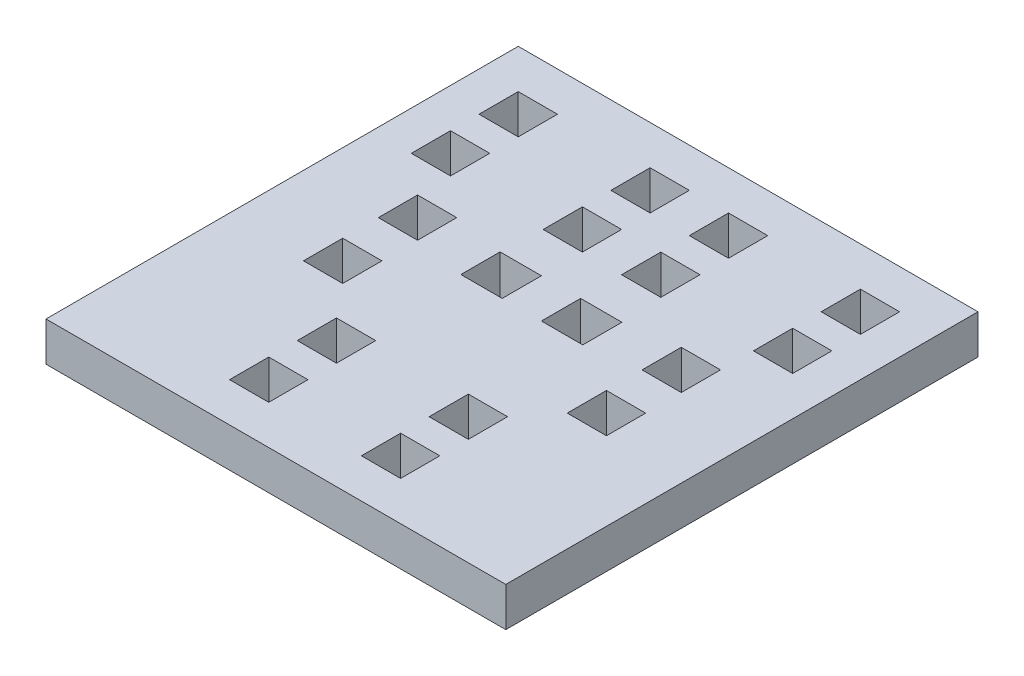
from build123d import *

# Parameters (mm, degrees)
SKETCH2_W           = 64.5
SKETCH2_H           = 66.25
SKETCH2_W_2         = 5.5
SKETCH2_H_2         = 5.5
SKETCH2_W_3         = 5.8
BOSS_EXTRUDE1_DEPTH = 5.5


with BuildPart() as part:
    # Sketch2 → Boss-Extrude1 (new body)
    with BuildSketch(Plane(origin=(0, 0, 0), x_dir=(1, 0, 0), z_dir=(0, 1, 0))):
        with Locations((-32.25, 33.125)):
            Rectangle(SKETCH2_W, SKETCH2_H)
        with Locations((-56.25, 58)):
            Rectangle(SKETCH2_W_2, SKETCH2_H_2, mode=Mode.SUBTRACT)
        with Locations((-56.25, 48.5)):
            Rectangle(SKETCH2_W_2, SKETCH2_H_2, mode=Mode.SUBTRACT)
        with Locations((-50.75, 38.375)):
            Rectangle(SKETCH2_W_2, SKETCH2_H_2, mode=Mode.SUBTRACT)
        with Locations((-50.75, 27.875)):
            Rectangle(SKETCH2_W_2, SKETCH2_H_2, mode=Mode.SUBTRACT)
        with Locations((-37.75, 58)):
            Rectangle(SKETCH2_W_2, SKETCH2_H_2, mode=Mode.SUBTRACT)
        with Locations((-37.75, 48.5)):
            Rectangle(SKETCH2_W_2, SKETCH2_H_2, mode=Mode.SUBTRACT)
        with Locations((-26.75, 58)):
            Rectangle(SKETCH2_W_2, SKETCH2_H_2, mode=Mode.SUBTRACT)
        with Locations((-26.75, 48.5)):
            Rectangle(SKETCH2_W_2, SKETCH2_H_2, mode=Mode.SUBTRACT)
        with Locations((-8.25, 58)):
            Rectangle(SKETCH2_W_2, SKETCH2_H_2, mode=Mode.SUBTRACT)
        with Locations((-8.25, 48.5)):
            Rectangle(SKETCH2_W_2, SKETCH2_H_2, mode=Mode.SUBTRACT)
        with Locations((-37.9, 37.25)):
            Rectangle(SKETCH2_W_3, SKETCH2_H_2, mode=Mode.SUBTRACT)
        with Locations((-26.6, 37.25)):
            Rectangle(SKETCH2_W_3, SKETCH2_H_2, mode=Mode.SUBTRACT)
        with Locations((-13.75, 38.375)):
            Rectangle(SKETCH2_W_2, SKETCH2_H_2, mode=Mode.SUBTRACT)
        with Locations((-13.75, 27.875)):
            Rectangle(SKETCH2_W_2, SKETCH2_H_2, mode=Mode.SUBTRACT)
        with Locations((-41.5, 17.75)):
            Rectangle(SKETCH2_W_2, SKETCH2_H_2, mode=Mode.SUBTRACT)
        with Locations((-41.5, 8.25)):
            Rectangle(SKETCH2_W_2, SKETCH2_H_2, mode=Mode.SUBTRACT)
        with Locations((-23, 17.75)):
            Rectangle(SKETCH2_W_2, SKETCH2_H_2, mode=Mode.SUBTRACT)
        with Locations((-23, 8.25)):
            Rectangle(SKETCH2_W_2, SKETCH2_H_2, mode=Mode.SUBTRACT)
    extrude(amount=BOSS_EXTRUDE1_DEPTH)


solid = part.part
